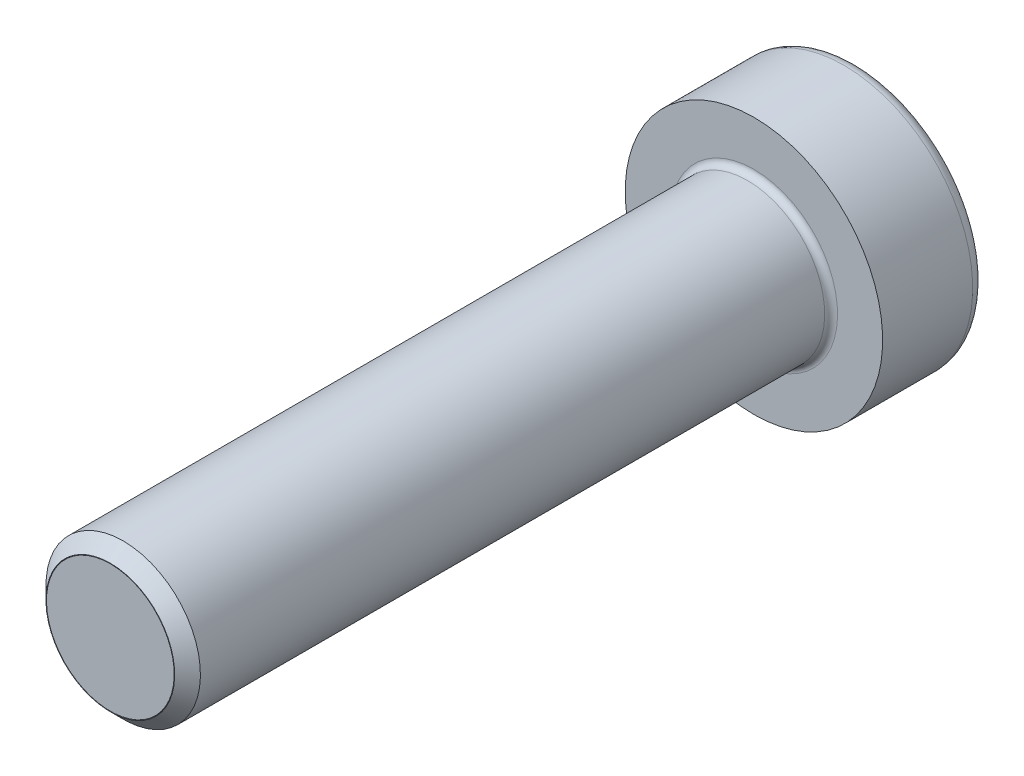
ISO-10303-21;
HEADER;
FILE_DESCRIPTION(('STEP AP214'),'2;1');
FILE_NAME('part.step','',(''),(''),'','','');
FILE_SCHEMA(('AUTOMOTIVE_DESIGN { 1 0 10303 214 1 1 1 1 }'));
ENDSEC;
DATA;
#1=APPLICATION_CONTEXT('core data for automotive mechanical design processes');
#2=APPLICATION_PROTOCOL_DEFINITION('international standard','automotive_design',2000,#1);
#3=PRODUCT_CONTEXT('',#1,'mechanical');
#4=PRODUCT('Part','Part','',(#3));
#5=PRODUCT_RELATED_PRODUCT_CATEGORY('part','',(#4));
#6=PRODUCT_DEFINITION_FORMATION('','',#4);
#7=PRODUCT_DEFINITION_CONTEXT('part definition',#1,'design');
#8=PRODUCT_DEFINITION('design','',#6,#7);
#9=PRODUCT_DEFINITION_SHAPE('','',#8);
#10=(LENGTH_UNIT() NAMED_UNIT(*) SI_UNIT(.MILLI.,.METRE.));
#11=(NAMED_UNIT(*) PLANE_ANGLE_UNIT() SI_UNIT($,.RADIAN.));
#12=(NAMED_UNIT(*) SI_UNIT($,.STERADIAN.) SOLID_ANGLE_UNIT());
#13=UNCERTAINTY_MEASURE_WITH_UNIT(LENGTH_MEASURE(1.E-05),#10,'distance_accuracy_value','');
#14=(GEOMETRIC_REPRESENTATION_CONTEXT(3) GLOBAL_UNCERTAINTY_ASSIGNED_CONTEXT((#13)) GLOBAL_UNIT_ASSIGNED_CONTEXT((#10,
#11,#12)) REPRESENTATION_CONTEXT('',''));
#15=CARTESIAN_POINT('',(0.,0.,0.));
#16=DIRECTION('',(0.,0.,1.));
#17=DIRECTION('',(1.,0.,0.));
#18=AXIS2_PLACEMENT_3D('',#15,#16,#17);
#19=CARTESIAN_POINT('',(0.,2.48,25.));
#20=DIRECTION('',(0.,0.,1.));
#21=DIRECTION('',(0.,-1.,0.));
#22=AXIS2_PLACEMENT_3D('',#19,#20,#21);
#23=PLANE('',#22);
#24=CARTESIAN_POINT('',(0.,0.,25.));
#25=DIRECTION('',(0.,0.,-1.));
#26=DIRECTION('',(0.,1.,0.));
#27=AXIS2_PLACEMENT_3D('',#24,#25,#26);
#28=CIRCLE('',#27,2.48);
#29=CARTESIAN_POINT('',(0.,2.48,25.));
#30=VERTEX_POINT('',#29);
#31=EDGE_CURVE('E133',#30,#30,#28,.T.);
#32=ORIENTED_EDGE('',*,*,#31,.F.);
#33=EDGE_LOOP('',(#32));
#34=FACE_BOUND('',#33,.T.);
#35=ADVANCED_FACE('F32',(#34),#23,.T.);
#36=CARTESIAN_POINT('',(0.,0.,-4.));
#37=DIRECTION('',(0.,0.,-1.));
#38=DIRECTION('',(0.,1.,0.));
#39=AXIS2_PLACEMENT_3D('',#36,#37,#38);
#40=PLANE('',#39);
#41=DIRECTION('',(-1.,0.,0.));
#42=VECTOR('',#41,1.);
#43=CARTESIAN_POINT('',(1.15470053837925,-2.,-4.));
#44=LINE('',#43,#42);
#45=CARTESIAN_POINT('',(1.15470053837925,-2.,-4.));
#46=VERTEX_POINT('',#45);
#47=CARTESIAN_POINT('',(-1.15470053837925,-2.,-4.));
#48=VERTEX_POINT('',#47);
#49=EDGE_CURVE('E46',#46,#48,#44,.T.);
#50=ORIENTED_EDGE('',*,*,#49,.F.);
#51=DIRECTION('',(-0.5,-0.866025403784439,0.));
#52=VECTOR('',#51,1.);
#53=CARTESIAN_POINT('',(2.3094010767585,0.,-4.));
#54=LINE('',#53,#52);
#55=CARTESIAN_POINT('',(2.3094010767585,0.,-4.));
#56=VERTEX_POINT('',#55);
#57=EDGE_CURVE('E129',#56,#46,#54,.T.);
#58=ORIENTED_EDGE('',*,*,#57,.F.);
#59=DIRECTION('',(0.5,-0.866025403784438,0.));
#60=VECTOR('',#59,1.);
#61=CARTESIAN_POINT('',(1.15470053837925,2.,-4.));
#62=LINE('',#61,#60);
#63=CARTESIAN_POINT('',(1.15470053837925,2.,-4.));
#64=VERTEX_POINT('',#63);
#65=EDGE_CURVE('E127',#64,#56,#62,.T.);
#66=ORIENTED_EDGE('',*,*,#65,.F.);
#67=DIRECTION('',(1.,0.,0.));
#68=VECTOR('',#67,1.);
#69=CARTESIAN_POINT('',(-1.15470053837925,2.,-4.));
#70=LINE('',#69,#68);
#71=CARTESIAN_POINT('',(-1.15470053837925,2.,-4.));
#72=VERTEX_POINT('',#71);
#73=EDGE_CURVE('E94',#72,#64,#70,.T.);
#74=ORIENTED_EDGE('',*,*,#73,.F.);
#75=DIRECTION('',(0.5,0.866025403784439,0.));
#76=VECTOR('',#75,1.);
#77=CARTESIAN_POINT('',(-2.3094010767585,0.,-4.));
#78=LINE('',#77,#76);
#79=CARTESIAN_POINT('',(-2.3094010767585,0.,-4.));
#80=VERTEX_POINT('',#79);
#81=EDGE_CURVE('E123',#80,#72,#78,.T.);
#82=ORIENTED_EDGE('',*,*,#81,.F.);
#83=DIRECTION('',(-0.5,0.866025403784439,0.));
#84=VECTOR('',#83,1.);
#85=CARTESIAN_POINT('',(-1.15470053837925,-2.,-4.));
#86=LINE('',#85,#84);
#87=EDGE_CURVE('E120',#48,#80,#86,.T.);
#88=ORIENTED_EDGE('',*,*,#87,.F.);
#89=EDGE_LOOP('',(#50,#58,#66,#74,#82,#88));
#90=FACE_BOUND('',#89,.T.);
#91=CARTESIAN_POINT('',(0.,0.,-4.));
#92=DIRECTION('',(0.,0.,-1.));
#93=DIRECTION('',(0.,1.,0.));
#94=AXIS2_PLACEMENT_3D('',#91,#92,#93);
#95=CIRCLE('',#94,4.5);
#96=CARTESIAN_POINT('',(0.,4.5,-4.));
#97=VERTEX_POINT('',#96);
#98=EDGE_CURVE('E11',#97,#97,#95,.T.);
#99=ORIENTED_EDGE('',*,*,#98,.T.);
#100=EDGE_LOOP('',(#99));
#101=FACE_BOUND('',#100,.T.);
#102=ADVANCED_FACE('F185',(#90,#101),#40,.T.);
#103=CARTESIAN_POINT('',(0.,0.,-3.5));
#104=DIRECTION('',(0.,0.,-1.));
#105=DIRECTION('',(0.,1.,0.));
#106=AXIS2_PLACEMENT_3D('',#103,#104,#105);
#107=TOROIDAL_SURFACE('',#106,4.5,0.5);
#108=CARTESIAN_POINT('',(0.,0.,-3.5));
#109=DIRECTION('',(0.,0.,-1.));
#110=DIRECTION('',(0.,1.,0.));
#111=AXIS2_PLACEMENT_3D('',#108,#109,#110);
#112=CIRCLE('',#111,5.);
#113=CARTESIAN_POINT('',(0.,5.,-3.5));
#114=VERTEX_POINT('',#113);
#115=EDGE_CURVE('E39',#114,#114,#112,.T.);
#116=ORIENTED_EDGE('',*,*,#115,.T.);
#117=EDGE_LOOP('',(#116));
#118=FACE_BOUND('',#117,.T.);
#119=ORIENTED_EDGE('',*,*,#98,.F.);
#120=EDGE_LOOP('',(#119));
#121=FACE_BOUND('',#120,.T.);
#122=ADVANCED_FACE('F170',(#118,#121),#107,.T.);
#123=CARTESIAN_POINT('',(0.,0.,25.));
#124=DIRECTION('',(0.,0.,-1.));
#125=DIRECTION('',(0.,1.,0.));
#126=AXIS2_PLACEMENT_3D('',#123,#124,#125);
#127=CYLINDRICAL_SURFACE('',#126,5.);
#128=CARTESIAN_POINT('',(0.,0.,0.));
#129=DIRECTION('',(0.,0.,-1.));
#130=DIRECTION('',(0.,1.,0.));
#131=AXIS2_PLACEMENT_3D('',#128,#129,#130);
#132=CIRCLE('',#131,5.);
#133=CARTESIAN_POINT('',(0.,5.,0.));
#134=VERTEX_POINT('',#133);
#135=EDGE_CURVE('E165',#134,#134,#132,.T.);
#136=ORIENTED_EDGE('',*,*,#135,.T.);
#137=EDGE_LOOP('',(#136));
#138=FACE_BOUND('',#137,.T.);
#139=ORIENTED_EDGE('',*,*,#115,.F.);
#140=EDGE_LOOP('',(#139));
#141=FACE_BOUND('',#140,.T.);
#142=ADVANCED_FACE('F173',(#138,#141),#127,.T.);
#143=CARTESIAN_POINT('',(0.,5.,0.));
#144=DIRECTION('',(0.,0.,1.));
#145=DIRECTION('',(0.,-1.,0.));
#146=AXIS2_PLACEMENT_3D('',#143,#144,#145);
#147=PLANE('',#146);
#148=CARTESIAN_POINT('',(0.,0.,0.));
#149=DIRECTION('',(0.,0.,-1.));
#150=DIRECTION('',(0.,1.,0.));
#151=AXIS2_PLACEMENT_3D('',#148,#149,#150);
#152=CIRCLE('',#151,3.25);
#153=CARTESIAN_POINT('',(0.,3.25,0.));
#154=VERTEX_POINT('',#153);
#155=EDGE_CURVE('E162',#154,#154,#152,.T.);
#156=ORIENTED_EDGE('',*,*,#155,.T.);
#157=EDGE_LOOP('',(#156));
#158=FACE_BOUND('',#157,.T.);
#159=ORIENTED_EDGE('',*,*,#135,.F.);
#160=EDGE_LOOP('',(#159));
#161=FACE_BOUND('',#160,.T.);
#162=ADVANCED_FACE('F175',(#158,#161),#147,.T.);
#163=CARTESIAN_POINT('',(0.,0.,0.25));
#164=DIRECTION('',(0.,0.,-1.));
#165=DIRECTION('',(0.,1.,0.));
#166=AXIS2_PLACEMENT_3D('',#163,#164,#165);
#167=TOROIDAL_SURFACE('',#166,3.25,0.25);
#168=CARTESIAN_POINT('',(0.,0.,0.25));
#169=DIRECTION('',(0.,0.,-1.));
#170=DIRECTION('',(0.,1.,0.));
#171=AXIS2_PLACEMENT_3D('',#168,#169,#170);
#172=CIRCLE('',#171,3.);
#173=CARTESIAN_POINT('',(0.,3.,0.250000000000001));
#174=VERTEX_POINT('',#173);
#175=EDGE_CURVE('E159',#174,#174,#172,.T.);
#176=ORIENTED_EDGE('',*,*,#175,.T.);
#177=EDGE_LOOP('',(#176));
#178=FACE_BOUND('',#177,.T.);
#179=ORIENTED_EDGE('',*,*,#155,.F.);
#180=EDGE_LOOP('',(#179));
#181=FACE_BOUND('',#180,.T.);
#182=ADVANCED_FACE('F182',(#178,#181),#167,.F.);
#183=CARTESIAN_POINT('',(0.,0.,25.));
#184=DIRECTION('',(0.,0.,-1.));
#185=DIRECTION('',(0.,1.,0.));
#186=AXIS2_PLACEMENT_3D('',#183,#184,#185);
#187=CYLINDRICAL_SURFACE('',#186,3.);
#188=CARTESIAN_POINT('',(0.,0.,24.5));
#189=DIRECTION('',(0.,0.,-1.));
#190=DIRECTION('',(0.,1.,0.));
#191=AXIS2_PLACEMENT_3D('',#188,#189,#190);
#192=CIRCLE('',#191,3.);
#193=CARTESIAN_POINT('',(0.,3.,24.5));
#194=VERTEX_POINT('',#193);
#195=EDGE_CURVE('E156',#194,#194,#192,.T.);
#196=ORIENTED_EDGE('',*,*,#195,.T.);
#197=EDGE_LOOP('',(#196));
#198=FACE_BOUND('',#197,.T.);
#199=ORIENTED_EDGE('',*,*,#175,.F.);
#200=EDGE_LOOP('',(#199));
#201=FACE_BOUND('',#200,.T.);
#202=ADVANCED_FACE('F229',(#198,#201),#187,.T.);
#203=CARTESIAN_POINT('',(0.,0.,24.5));
#204=DIRECTION('',(0.,0.,-1.));
#205=DIRECTION('',(0.,1.,0.));
#206=AXIS2_PLACEMENT_3D('',#203,#204,#205);
#207=CONICAL_SURFACE('',#206,3.,0.785398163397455);
#208=CARTESIAN_POINT('',(0.,0.,25.));
#209=DIRECTION('',(0.,0.,-1.));
#210=DIRECTION('',(0.,1.,0.));
#211=AXIS2_PLACEMENT_3D('',#208,#209,#210);
#212=CIRCLE('',#211,2.5);
#213=CARTESIAN_POINT('',(0.,2.5,25.));
#214=VERTEX_POINT('',#213);
#215=EDGE_CURVE('E153',#214,#214,#212,.T.);
#216=ORIENTED_EDGE('',*,*,#215,.T.);
#217=EDGE_LOOP('',(#216));
#218=FACE_BOUND('',#217,.T.);
#219=ORIENTED_EDGE('',*,*,#195,.F.);
#220=EDGE_LOOP('',(#219));
#221=FACE_BOUND('',#220,.T.);
#222=ADVANCED_FACE('F223',(#218,#221),#207,.T.);
#223=CARTESIAN_POINT('',(0.,0.,25.));
#224=DIRECTION('',(0.,0.,-1.));
#225=DIRECTION('',(0.,1.,0.));
#226=AXIS2_PLACEMENT_3D('',#223,#224,#225);
#227=CYLINDRICAL_SURFACE('',#226,2.5);
#228=CARTESIAN_POINT('',(0.,0.,3.));
#229=DIRECTION('',(0.,0.,-1.));
#230=DIRECTION('',(0.,1.,0.));
#231=AXIS2_PLACEMENT_3D('',#228,#229,#230);
#232=CIRCLE('',#231,2.5);
#233=CARTESIAN_POINT('',(0.,2.5,3.));
#234=VERTEX_POINT('',#233);
#235=EDGE_CURVE('E150',#234,#234,#232,.T.);
#236=ORIENTED_EDGE('',*,*,#235,.T.);
#237=EDGE_LOOP('',(#236));
#238=FACE_BOUND('',#237,.T.);
#239=ORIENTED_EDGE('',*,*,#215,.F.);
#240=EDGE_LOOP('',(#239));
#241=FACE_BOUND('',#240,.T.);
#242=ADVANCED_FACE('F217',(#238,#241),#227,.F.);
#243=CARTESIAN_POINT('',(0.,0.,3.));
#244=DIRECTION('',(0.,0.,-1.));
#245=DIRECTION('',(0.,1.,0.));
#246=AXIS2_PLACEMENT_3D('',#243,#244,#245);
#247=CONICAL_SURFACE('',#246,2.5,0.785398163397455);
#248=CARTESIAN_POINT('',(0.,0.,2.52000000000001));
#249=DIRECTION('',(0.,0.,-1.));
#250=DIRECTION('',(0.,1.,0.));
#251=AXIS2_PLACEMENT_3D('',#248,#249,#250);
#252=CIRCLE('',#251,2.98);
#253=CARTESIAN_POINT('',(0.,2.98,2.52000000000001));
#254=VERTEX_POINT('',#253);
#255=EDGE_CURVE('E147',#254,#254,#252,.T.);
#256=ORIENTED_EDGE('',*,*,#255,.T.);
#257=EDGE_LOOP('',(#256));
#258=FACE_BOUND('',#257,.T.);
#259=ORIENTED_EDGE('',*,*,#235,.F.);
#260=EDGE_LOOP('',(#259));
#261=FACE_BOUND('',#260,.T.);
#262=ADVANCED_FACE('F211',(#258,#261),#247,.F.);
#263=CARTESIAN_POINT('',(0.,0.,25.));
#264=DIRECTION('',(0.,0.,-1.));
#265=DIRECTION('',(0.,1.,0.));
#266=AXIS2_PLACEMENT_3D('',#263,#264,#265);
#267=CYLINDRICAL_SURFACE('',#266,2.98);
#268=CARTESIAN_POINT('',(0.,0.,2.50000000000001));
#269=DIRECTION('',(0.,0.,-1.));
#270=DIRECTION('',(0.,1.,0.));
#271=AXIS2_PLACEMENT_3D('',#268,#269,#270);
#272=CIRCLE('',#271,2.98);
#273=CARTESIAN_POINT('',(0.,2.98,2.50000000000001));
#274=VERTEX_POINT('',#273);
#275=EDGE_CURVE('E144',#274,#274,#272,.T.);
#276=ORIENTED_EDGE('',*,*,#275,.T.);
#277=EDGE_LOOP('',(#276));
#278=FACE_BOUND('',#277,.T.);
#279=ORIENTED_EDGE('',*,*,#255,.F.);
#280=EDGE_LOOP('',(#279));
#281=FACE_BOUND('',#280,.T.);
#282=ADVANCED_FACE('F205',(#278,#281),#267,.F.);
#283=CARTESIAN_POINT('',(0.,0.,2.50000000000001));
#284=DIRECTION('',(0.,0.,-1.));
#285=DIRECTION('',(0.,1.,0.));
#286=AXIS2_PLACEMENT_3D('',#283,#284,#285);
#287=CONICAL_SURFACE('',#286,2.98,0.785398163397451);
#288=CARTESIAN_POINT('',(0.,0.,3.00000000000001));
#289=DIRECTION('',(0.,0.,-1.));
#290=DIRECTION('',(0.,1.,0.));
#291=AXIS2_PLACEMENT_3D('',#288,#289,#290);
#292=CIRCLE('',#291,2.48);
#293=CARTESIAN_POINT('',(0.,2.48,3.00000000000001));
#294=VERTEX_POINT('',#293);
#295=EDGE_CURVE('E141',#294,#294,#292,.T.);
#296=ORIENTED_EDGE('',*,*,#295,.T.);
#297=EDGE_LOOP('',(#296));
#298=FACE_BOUND('',#297,.T.);
#299=ORIENTED_EDGE('',*,*,#275,.F.);
#300=EDGE_LOOP('',(#299));
#301=FACE_BOUND('',#300,.T.);
#302=ADVANCED_FACE('F199',(#298,#301),#287,.T.);
#303=CARTESIAN_POINT('',(0.,0.,25.));
#304=DIRECTION('',(0.,0.,-1.));
#305=DIRECTION('',(0.,1.,0.));
#306=AXIS2_PLACEMENT_3D('',#303,#304,#305);
#307=CYLINDRICAL_SURFACE('',#306,2.48);
#308=ORIENTED_EDGE('',*,*,#31,.T.);
#309=EDGE_LOOP('',(#308));
#310=FACE_BOUND('',#309,.T.);
#311=ORIENTED_EDGE('',*,*,#295,.F.);
#312=EDGE_LOOP('',(#311));
#313=FACE_BOUND('',#312,.T.);
#314=ADVANCED_FACE('F195',(#310,#313),#307,.T.);
#315=CARTESIAN_POINT('',(1.15470053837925,-2.,-2.));
#316=DIRECTION('',(0.,-1.,0.));
#317=DIRECTION('',(1.,0.,0.));
#318=AXIS2_PLACEMENT_3D('',#315,#316,#317);
#319=PLANE('',#318);
#320=ORIENTED_EDGE('',*,*,#49,.T.);
#321=DIRECTION('',(0.,0.,-1.));
#322=VECTOR('',#321,1.);
#323=CARTESIAN_POINT('',(-1.15470053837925,-2.,-2.));
#324=LINE('',#323,#322);
#325=CARTESIAN_POINT('',(-1.15470053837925,-2.,-2.));
#326=VERTEX_POINT('',#325);
#327=EDGE_CURVE('E76',#326,#48,#324,.T.);
#328=ORIENTED_EDGE('',*,*,#327,.F.);
#329=DIRECTION('',(-1.,0.,0.));
#330=VECTOR('',#329,1.);
#331=CARTESIAN_POINT('',(1.15470053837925,-2.,-2.));
#332=LINE('',#331,#330);
#333=CARTESIAN_POINT('',(1.15470053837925,-2.,-2.));
#334=VERTEX_POINT('',#333);
#335=EDGE_CURVE('E131',#334,#326,#332,.T.);
#336=ORIENTED_EDGE('',*,*,#335,.F.);
#337=DIRECTION('',(0.,0.,-1.));
#338=VECTOR('',#337,1.);
#339=CARTESIAN_POINT('',(1.15470053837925,-2.,-2.));
#340=LINE('',#339,#338);
#341=EDGE_CURVE('E54',#334,#46,#340,.T.);
#342=ORIENTED_EDGE('',*,*,#341,.T.);
#343=EDGE_LOOP('',(#320,#328,#336,#342));
#344=FACE_BOUND('',#343,.T.);
#345=ADVANCED_FACE('F198',(#344),#319,.F.);
#346=CARTESIAN_POINT('',(2.3094010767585,0.,-2.));
#347=DIRECTION('',(0.866025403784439,-0.5,0.));
#348=DIRECTION('',(0.5,0.866025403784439,0.));
#349=AXIS2_PLACEMENT_3D('',#346,#347,#348);
#350=PLANE('',#349);
#351=ORIENTED_EDGE('',*,*,#57,.T.);
#352=ORIENTED_EDGE('',*,*,#341,.F.);
#353=DIRECTION('',(-0.5,-0.866025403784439,0.));
#354=VECTOR('',#353,1.);
#355=CARTESIAN_POINT('',(2.3094010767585,0.,-2.));
#356=LINE('',#355,#354);
#357=CARTESIAN_POINT('',(2.3094010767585,0.,-2.));
#358=VERTEX_POINT('',#357);
#359=EDGE_CURVE('E106',#358,#334,#356,.T.);
#360=ORIENTED_EDGE('',*,*,#359,.F.);
#361=DIRECTION('',(0.,0.,-1.));
#362=VECTOR('',#361,1.);
#363=CARTESIAN_POINT('',(2.3094010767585,0.,-2.));
#364=LINE('',#363,#362);
#365=EDGE_CURVE('E98',#358,#56,#364,.T.);
#366=ORIENTED_EDGE('',*,*,#365,.T.);
#367=EDGE_LOOP('',(#351,#352,#360,#366));
#368=FACE_BOUND('',#367,.T.);
#369=ADVANCED_FACE('F249',(#368),#350,.F.);
#370=CARTESIAN_POINT('',(1.15470053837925,2.,-2.));
#371=DIRECTION('',(0.866025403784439,0.5,0.));
#372=DIRECTION('',(-0.5,0.866025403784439,0.));
#373=AXIS2_PLACEMENT_3D('',#370,#371,#372);
#374=PLANE('',#373);
#375=ORIENTED_EDGE('',*,*,#65,.T.);
#376=ORIENTED_EDGE('',*,*,#365,.F.);
#377=DIRECTION('',(0.5,-0.866025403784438,0.));
#378=VECTOR('',#377,1.);
#379=CARTESIAN_POINT('',(1.15470053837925,2.,-2.));
#380=LINE('',#379,#378);
#381=CARTESIAN_POINT('',(1.15470053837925,2.,-2.));
#382=VERTEX_POINT('',#381);
#383=EDGE_CURVE('E102',#382,#358,#380,.T.);
#384=ORIENTED_EDGE('',*,*,#383,.F.);
#385=DIRECTION('',(0.,0.,-1.));
#386=VECTOR('',#385,1.);
#387=CARTESIAN_POINT('',(1.15470053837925,2.,-2.));
#388=LINE('',#387,#386);
#389=EDGE_CURVE('E87',#382,#64,#388,.T.);
#390=ORIENTED_EDGE('',*,*,#389,.T.);
#391=EDGE_LOOP('',(#375,#376,#384,#390));
#392=FACE_BOUND('',#391,.T.);
#393=ADVANCED_FACE('F103',(#392),#374,.F.);
#394=CARTESIAN_POINT('',(-1.15470053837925,2.,-2.));
#395=DIRECTION('',(0.,1.,0.));
#396=DIRECTION('',(0.,0.,1.));
#397=AXIS2_PLACEMENT_3D('',#394,#395,#396);
#398=PLANE('',#397);
#399=ORIENTED_EDGE('',*,*,#73,.T.);
#400=ORIENTED_EDGE('',*,*,#389,.F.);
#401=DIRECTION('',(1.,0.,0.));
#402=VECTOR('',#401,1.);
#403=CARTESIAN_POINT('',(-1.15470053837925,2.,-2.));
#404=LINE('',#403,#402);
#405=CARTESIAN_POINT('',(-1.15470053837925,2.,-2.));
#406=VERTEX_POINT('',#405);
#407=EDGE_CURVE('E91',#406,#382,#404,.T.);
#408=ORIENTED_EDGE('',*,*,#407,.F.);
#409=DIRECTION('',(0.,0.,-1.));
#410=VECTOR('',#409,1.);
#411=CARTESIAN_POINT('',(-1.15470053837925,2.,-2.));
#412=LINE('',#411,#410);
#413=EDGE_CURVE('E99',#406,#72,#412,.T.);
#414=ORIENTED_EDGE('',*,*,#413,.T.);
#415=EDGE_LOOP('',(#399,#400,#408,#414));
#416=FACE_BOUND('',#415,.T.);
#417=ADVANCED_FACE('F89',(#416),#398,.F.);
#418=CARTESIAN_POINT('',(-2.3094010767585,0.,-2.));
#419=DIRECTION('',(-0.866025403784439,0.5,0.));
#420=DIRECTION('',(-0.5,-0.866025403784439,0.));
#421=AXIS2_PLACEMENT_3D('',#418,#419,#420);
#422=PLANE('',#421);
#423=ORIENTED_EDGE('',*,*,#81,.T.);
#424=ORIENTED_EDGE('',*,*,#413,.F.);
#425=DIRECTION('',(0.5,0.866025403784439,0.));
#426=VECTOR('',#425,1.);
#427=CARTESIAN_POINT('',(-2.3094010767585,0.,-2.));
#428=LINE('',#427,#426);
#429=CARTESIAN_POINT('',(-2.3094010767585,0.,-2.));
#430=VERTEX_POINT('',#429);
#431=EDGE_CURVE('E112',#430,#406,#428,.T.);
#432=ORIENTED_EDGE('',*,*,#431,.F.);
#433=DIRECTION('',(0.,0.,-1.));
#434=VECTOR('',#433,1.);
#435=CARTESIAN_POINT('',(-2.3094010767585,0.,-2.));
#436=LINE('',#435,#434);
#437=EDGE_CURVE('E136',#430,#80,#436,.T.);
#438=ORIENTED_EDGE('',*,*,#437,.T.);
#439=EDGE_LOOP('',(#423,#424,#432,#438));
#440=FACE_BOUND('',#439,.T.);
#441=ADVANCED_FACE('F253',(#440),#422,.F.);
#442=CARTESIAN_POINT('',(-1.15470053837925,-2.,-2.));
#443=DIRECTION('',(-0.866025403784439,-0.5,0.));
#444=DIRECTION('',(0.5,-0.866025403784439,0.));
#445=AXIS2_PLACEMENT_3D('',#442,#443,#444);
#446=PLANE('',#445);
#447=ORIENTED_EDGE('',*,*,#87,.T.);
#448=ORIENTED_EDGE('',*,*,#437,.F.);
#449=DIRECTION('',(-0.5,0.866025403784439,0.));
#450=VECTOR('',#449,1.);
#451=CARTESIAN_POINT('',(-1.15470053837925,-2.,-2.));
#452=LINE('',#451,#450);
#453=EDGE_CURVE('E114',#326,#430,#452,.T.);
#454=ORIENTED_EDGE('',*,*,#453,.F.);
#455=ORIENTED_EDGE('',*,*,#327,.T.);
#456=EDGE_LOOP('',(#447,#448,#454,#455));
#457=FACE_BOUND('',#456,.T.);
#458=ADVANCED_FACE('F250',(#457),#446,.F.);
#459=CARTESIAN_POINT('',(0.,0.,-2.));
#460=DIRECTION('',(0.,0.,-1.));
#461=DIRECTION('',(-1.,0.,0.));
#462=AXIS2_PLACEMENT_3D('',#459,#460,#461);
#463=PLANE('',#462);
#464=ORIENTED_EDGE('',*,*,#335,.T.);
#465=ORIENTED_EDGE('',*,*,#453,.T.);
#466=ORIENTED_EDGE('',*,*,#431,.T.);
#467=ORIENTED_EDGE('',*,*,#407,.T.);
#468=ORIENTED_EDGE('',*,*,#383,.T.);
#469=ORIENTED_EDGE('',*,*,#359,.T.);
#470=EDGE_LOOP('',(#464,#465,#466,#467,#468,#469));
#471=FACE_BOUND('',#470,.T.);
#472=ADVANCED_FACE('F109',(#471),#463,.T.);
#473=CLOSED_SHELL('',(#35,#102,#122,#142,#162,#182,#202,#222,#242,#262,#282,#302,#314,#345,#369,
#393,#417,#441,#458,#472));
#474=MANIFOLD_SOLID_BREP('B2',#473);
#475=ADVANCED_BREP_SHAPE_REPRESENTATION('',(#18,#474),#14);
#476=SHAPE_DEFINITION_REPRESENTATION(#9,#475);
ENDSEC;
END-ISO-10303-21;
